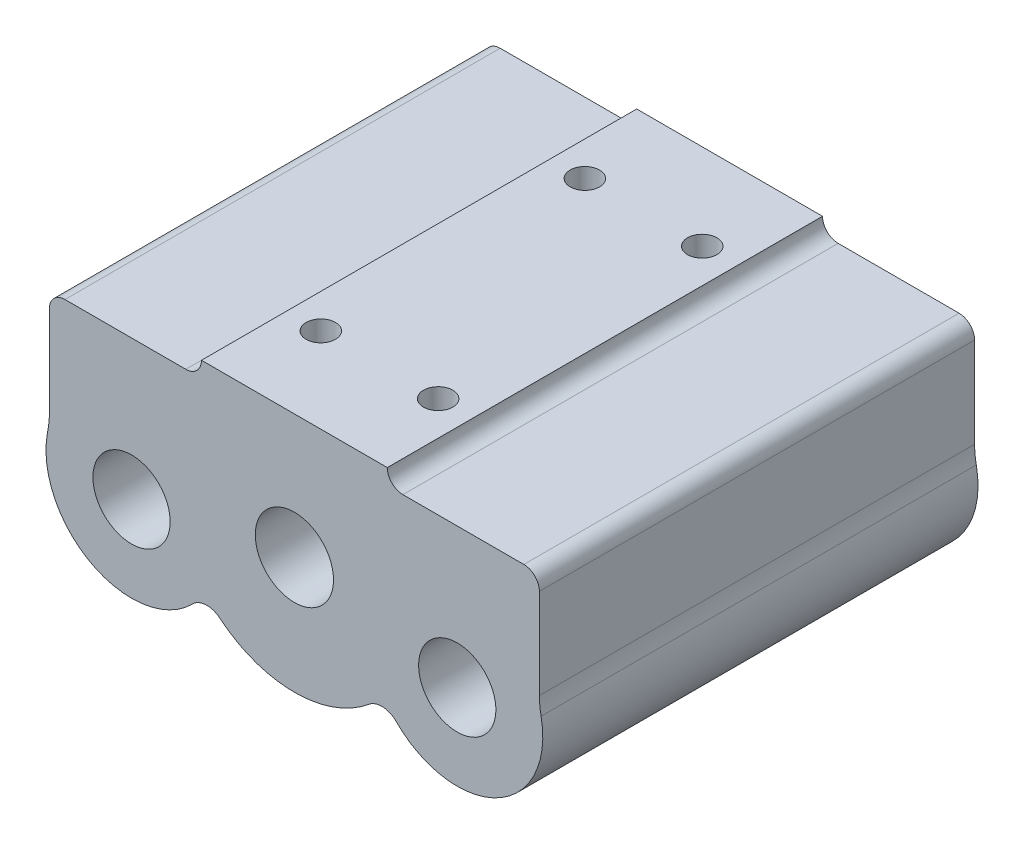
from build123d import *

# Parameters (mm, degrees)
BASE_EXTRUDE_START              = -44.502
BASE_EXTRUDE_DEPTH              = 44.502
CUT_EXTRUDE5_DEPTH              = 37.088377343
CUT_EXTRUDE5_DEPTH_BACK         = 37.088377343
SKETCH4_R                       = 4
SKETCH2_R                       = 3.95
CUT_EXTRUDE4_DEPTH              = 53.798176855
M3X0_5_TAPPED_HOLE1_D           = 2.5
M3X0_5_TAPPED_HOLE1_DEPTH       = 8.5
M3X0_5_TAPPED_HOLE1_CBORE_D     = 3
M3X0_5_TAPPED_HOLE1_CBORE_DEPTH = 6
M3X0_5_TAPPED_HOLE1_TIP         = 0.751075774


with BuildPart() as part:
    # Sketch1 → Base-Extrude (new body)
    with BuildSketch(Plane(origin=(0, 0, -414.05050097), x_dir=(-1, 0, 0), z_dir=(0, 0, 1)).offset(BASE_EXTRUDE_START)):
        with BuildLine():
            Line((25.034857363, -0.28245603), (25.034857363, -9.5125))
            ThreePointArc((25.034857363, -9.5125), (24.569889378, -10.635032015), (23.447357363, -11.1))
            Line((23.447357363, -11.1), (11.084857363, -11.1))
            ThreePointArc((11.084857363, -11.1), (9.953486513, -11.56862915), (9.484857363, -12.7))
            Line((9.484857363, -12.7), (-9.515142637, -12.7))
            ThreePointArc((-9.515142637, -12.7), (-9.983771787, -11.56862915), (-11.115142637, -11.1))
            Line((-11.115142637, -11.1), (-23.477642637, -11.1))
            ThreePointArc((-23.477642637, -11.1), (-24.600174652, -10.635032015), (-25.065142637, -9.5125))
            Line((-25.065142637, -9.5125), (-25.065142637, -0.28245603))
            ThreePointArc((-25.065142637, -0.28245603), (-25.109002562, 0.59254397), (-25.240142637, 1.458771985))
            ThreePointArc((-25.240142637, 1.458771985), (-20.77536819, 10.924541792), (-10.430252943, 9.339108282))
            ThreePointArc((-10.430252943, 9.339108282), (-9.064169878, 8.72615396), (-7.643342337, 9.19853626))
            ThreePointArc((-7.643342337, 9.19853626), (-0.015142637, 11.95), (7.613057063, 9.19853626))
            ThreePointArc((7.613057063, 9.19853626), (9.033884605, 8.72615396), (10.399967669, 9.339108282))
            ThreePointArc((10.399967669, 9.339108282), (20.745082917, 10.924541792), (25.209857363, 1.458771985))
            ThreePointArc((25.209857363, 1.458771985), (25.078717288, 0.59254397), (25.034857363, -0.28245603))
        make_face()
    extrude(amount=BASE_EXTRUDE_DEPTH)

    # Sketch4 → Cut-Extrude5 (cut, two sides: drawn at the far end of the back side and taken through both)
    with BuildSketch(Plane.XY.offset(-436.30050097).offset(-CUT_EXTRUDE5_DEPTH_BACK)):
        with Locations((0.015142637, 0)):
            Circle(SKETCH4_R)
    extrude(amount=CUT_EXTRUDE5_DEPTH + CUT_EXTRUDE5_DEPTH_BACK, mode=Mode.SUBTRACT)

    # Sketch2 → Cut-Extrude4 (cut, through all)
    with BuildSketch(Plane(origin=(0, 0, -458.55250097), x_dir=(-1, 0, 0), z_dir=(0, 0, -1))):
        with Locations((16.634857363, -3.2)):
            Circle(SKETCH2_R)
        with Locations((-16.665142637, -3.2)):
            Circle(SKETCH2_R)
    extrude(amount=-CUT_EXTRUDE4_DEPTH, mode=Mode.SUBTRACT)

    # M3X0.5 Tapped Hole1
    with Locations(Plane(origin=(0, 12.7, 0), x_dir=(-1, 0, 0), z_dir=(0, 1, 0))):
        with Locations((5.984857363, -422.75050097), (5.984857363, -449.75050097), (-6.015142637, -449.75050097), (-6.015142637, -422.75050097)):
            CounterBoreHole(M3X0_5_TAPPED_HOLE1_D / 2, M3X0_5_TAPPED_HOLE1_CBORE_D / 2, M3X0_5_TAPPED_HOLE1_CBORE_DEPTH, depth=M3X0_5_TAPPED_HOLE1_DEPTH)
            with Locations((0, 0, -(M3X0_5_TAPPED_HOLE1_DEPTH + M3X0_5_TAPPED_HOLE1_TIP / 2))):  # 118° drill point
                Cone(0, M3X0_5_TAPPED_HOLE1_D / 2, M3X0_5_TAPPED_HOLE1_TIP, mode=Mode.SUBTRACT)


solid = part.part
